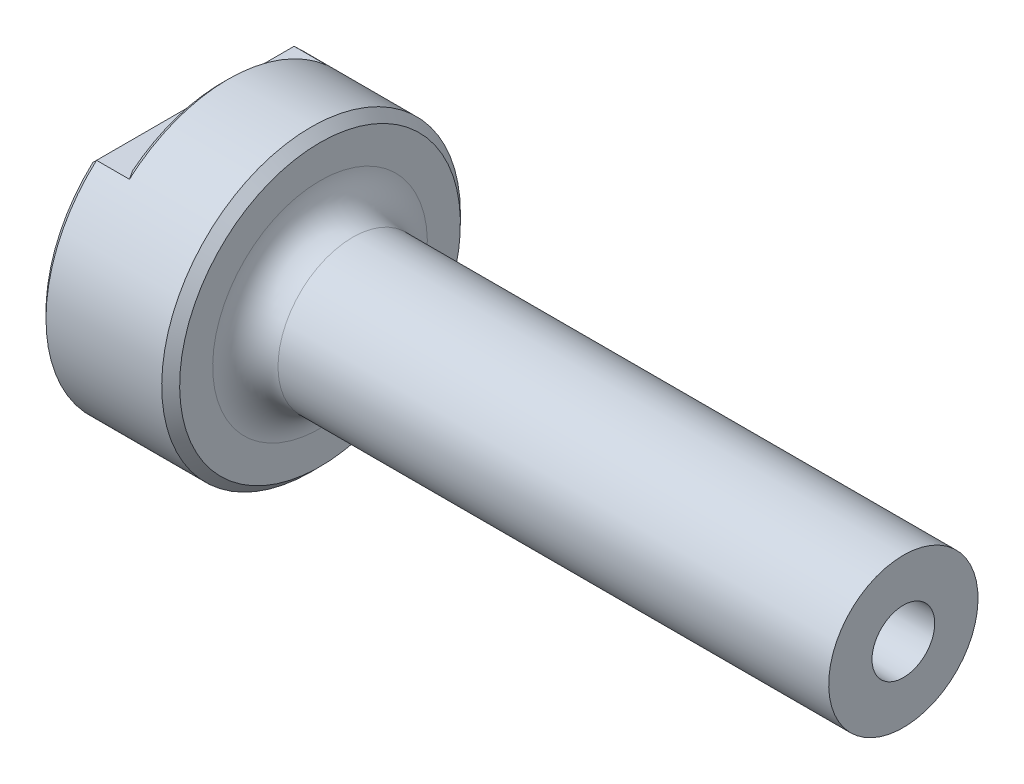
ISO-10303-21;
HEADER;
FILE_DESCRIPTION(('STEP AP214'),'2;1');
FILE_NAME('part.step','',(''),(''),'','','');
FILE_SCHEMA(('AUTOMOTIVE_DESIGN { 1 0 10303 214 1 1 1 1 }'));
ENDSEC;
DATA;
#1=APPLICATION_CONTEXT('core data for automotive mechanical design processes');
#2=APPLICATION_PROTOCOL_DEFINITION('international standard','automotive_design',2000,#1);
#3=PRODUCT_CONTEXT('',#1,'mechanical');
#4=PRODUCT('Part','Part','',(#3));
#5=PRODUCT_RELATED_PRODUCT_CATEGORY('part','',(#4));
#6=PRODUCT_DEFINITION_FORMATION('','',#4);
#7=PRODUCT_DEFINITION_CONTEXT('part definition',#1,'design');
#8=PRODUCT_DEFINITION('design','',#6,#7);
#9=PRODUCT_DEFINITION_SHAPE('','',#8);
#10=(LENGTH_UNIT() NAMED_UNIT(*) SI_UNIT(.MILLI.,.METRE.));
#11=(NAMED_UNIT(*) PLANE_ANGLE_UNIT() SI_UNIT($,.RADIAN.));
#12=(NAMED_UNIT(*) SI_UNIT($,.STERADIAN.) SOLID_ANGLE_UNIT());
#13=UNCERTAINTY_MEASURE_WITH_UNIT(LENGTH_MEASURE(1.E-05),#10,'distance_accuracy_value','');
#14=(GEOMETRIC_REPRESENTATION_CONTEXT(3) GLOBAL_UNCERTAINTY_ASSIGNED_CONTEXT((#13)) GLOBAL_UNIT_ASSIGNED_CONTEXT((#10,
#11,#12)) REPRESENTATION_CONTEXT('',''));
#15=CARTESIAN_POINT('',(0.,0.,0.));
#16=DIRECTION('',(0.,0.,1.));
#17=DIRECTION('',(1.,0.,0.));
#18=AXIS2_PLACEMENT_3D('',#15,#16,#17);
#19=CARTESIAN_POINT('',(60.721875,0.,0.));
#20=DIRECTION('',(1.,0.,0.));
#21=DIRECTION('',(0.,0.,-1.));
#22=AXIS2_PLACEMENT_3D('',#19,#20,#21);
#23=PLANE('',#22);
#24=CARTESIAN_POINT('',(60.721875,0.,0.));
#25=DIRECTION('',(1.,0.,0.));
#26=DIRECTION('',(0.,1.,0.));
#27=AXIS2_PLACEMENT_3D('',#24,#25,#26);
#28=CIRCLE('',#27,12.7);
#29=CARTESIAN_POINT('',(60.721875,12.7,0.));
#30=VERTEX_POINT('',#29);
#31=EDGE_CURVE('E102',#30,#30,#28,.T.);
#32=ORIENTED_EDGE('',*,*,#31,.T.);
#33=EDGE_LOOP('',(#32));
#34=FACE_BOUND('',#33,.T.);
#35=CARTESIAN_POINT('',(60.721875,0.,0.));
#36=DIRECTION('',(1.,0.,0.));
#37=DIRECTION('',(0.,1.,0.));
#38=AXIS2_PLACEMENT_3D('',#35,#36,#37);
#39=CIRCLE('',#38,5.33387866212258);
#40=CARTESIAN_POINT('',(60.721875,5.33387866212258,0.));
#41=VERTEX_POINT('',#40);
#42=EDGE_CURVE('E158',#41,#41,#39,.T.);
#43=ORIENTED_EDGE('',*,*,#42,.F.);
#44=EDGE_LOOP('',(#43));
#45=FACE_BOUND('',#44,.T.);
#46=ADVANCED_FACE('F33',(#34,#45),#23,.T.);
#47=CARTESIAN_POINT('',(-60.721875,0.,0.));
#48=DIRECTION('',(1.,0.,0.));
#49=DIRECTION('',(0.,0.,-1.));
#50=AXIS2_PLACEMENT_3D('',#47,#48,#49);
#51=PLANE('',#50);
#52=CARTESIAN_POINT('',(-60.721875,0.,0.));
#53=DIRECTION('',(1.,0.,0.));
#54=DIRECTION('',(0.,0.,-1.));
#55=AXIS2_PLACEMENT_3D('',#52,#53,#54);
#56=CIRCLE('',#55,24.3839999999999);
#57=CARTESIAN_POINT('',(-60.721875,18.0339999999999,-16.4120169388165));
#58=VERTEX_POINT('',#57);
#59=CARTESIAN_POINT('',(-60.721875,18.0339999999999,16.4120169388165));
#60=VERTEX_POINT('',#59);
#61=EDGE_CURVE('E53',#58,#60,#56,.F.);
#62=ORIENTED_EDGE('',*,*,#61,.T.);
#63=DIRECTION('',(0.,0.,-1.));
#64=VECTOR('',#63,1.);
#65=CARTESIAN_POINT('',(-60.721875,18.0339999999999,0.));
#66=LINE('',#65,#64);
#67=EDGE_CURVE('E127',#60,#58,#66,.T.);
#68=ORIENTED_EDGE('',*,*,#67,.T.);
#69=EDGE_LOOP('',(#62,#68));
#70=FACE_BOUND('',#69,.T.);
#71=CARTESIAN_POINT('',(-60.721875,0.,0.));
#72=DIRECTION('',(1.,0.,0.));
#73=DIRECTION('',(0.,1.,0.));
#74=AXIS2_PLACEMENT_3D('',#71,#72,#73);
#75=CIRCLE('',#74,9.80045101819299);
#76=CARTESIAN_POINT('',(-60.721875,9.80045101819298,0.));
#77=VERTEX_POINT('',#76);
#78=EDGE_CURVE('E107',#77,#77,#75,.T.);
#79=ORIENTED_EDGE('',*,*,#78,.T.);
#80=EDGE_LOOP('',(#79));
#81=FACE_BOUND('',#80,.T.);
#82=ADVANCED_FACE('F167',(#70,#81),#51,.F.);
#83=CARTESIAN_POINT('',(60.721875,0.,0.));
#84=DIRECTION('',(-1.,0.,0.));
#85=DIRECTION('',(0.,0.,1.));
#86=AXIS2_PLACEMENT_3D('',#83,#84,#85);
#87=CYLINDRICAL_SURFACE('',#86,25.4);
#88=CARTESIAN_POINT('',(-40.0208749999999,0.,0.));
#89=DIRECTION('',(1.,0.,0.));
#90=DIRECTION('',(0.,0.,-1.));
#91=AXIS2_PLACEMENT_3D('',#88,#89,#90);
#92=CIRCLE('',#91,25.4);
#93=CARTESIAN_POINT('',(-40.0208749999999,0.,-25.4));
#94=VERTEX_POINT('',#93);
#95=EDGE_CURVE('E98',#94,#94,#92,.F.);
#96=ORIENTED_EDGE('',*,*,#95,.T.);
#97=EDGE_LOOP('',(#96));
#98=FACE_BOUND('',#97,.T.);
#99=DIRECTION('',(-1.,0.,0.));
#100=VECTOR('',#99,1.);
#101=CARTESIAN_POINT('',(60.721875,19.05,-16.8005208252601));
#102=LINE('',#101,#100);
#103=CARTESIAN_POINT('',(-59.7058749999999,19.05,-16.8005208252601));
#104=VERTEX_POINT('',#103);
#105=CARTESIAN_POINT('',(-54.117875,19.05,-16.8005208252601));
#106=VERTEX_POINT('',#105);
#107=EDGE_CURVE('E101',#104,#106,#102,.F.);
#108=ORIENTED_EDGE('',*,*,#107,.T.);
#109=CARTESIAN_POINT('',(-54.117875,0.,0.));
#110=DIRECTION('',(-1.,0.,0.));
#111=DIRECTION('',(0.,0.,1.));
#112=AXIS2_PLACEMENT_3D('',#109,#110,#111);
#113=CIRCLE('',#112,25.4);
#114=CARTESIAN_POINT('',(-54.117875,19.05,16.8005208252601));
#115=VERTEX_POINT('',#114);
#116=EDGE_CURVE('E87',#106,#115,#113,.F.);
#117=ORIENTED_EDGE('',*,*,#116,.T.);
#118=DIRECTION('',(-1.,0.,0.));
#119=VECTOR('',#118,1.);
#120=CARTESIAN_POINT('',(60.721875,19.05,16.8005208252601));
#121=LINE('',#120,#119);
#122=CARTESIAN_POINT('',(-59.7058749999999,19.05,16.8005208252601));
#123=VERTEX_POINT('',#122);
#124=EDGE_CURVE('E104',#115,#123,#121,.T.);
#125=ORIENTED_EDGE('',*,*,#124,.T.);
#126=CARTESIAN_POINT('',(-59.7058749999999,0.,0.));
#127=DIRECTION('',(1.,0.,0.));
#128=DIRECTION('',(0.,0.,-1.));
#129=AXIS2_PLACEMENT_3D('',#126,#127,#128);
#130=CIRCLE('',#129,25.4);
#131=EDGE_CURVE('E97',#123,#104,#130,.T.);
#132=ORIENTED_EDGE('',*,*,#131,.T.);
#133=EDGE_LOOP('',(#108,#117,#125,#132));
#134=FACE_BOUND('',#133,.T.);
#135=ADVANCED_FACE('F189',(#98,#134),#87,.T.);
#136=CARTESIAN_POINT('',(-55.133875,0.,0.));
#137=DIRECTION('',(-1.,0.,0.));
#138=DIRECTION('',(0.,0.,1.));
#139=AXIS2_PLACEMENT_3D('',#136,#137,#138);
#140=PLANE('',#139);
#141=DIRECTION('',(0.,0.,1.));
#142=VECTOR('',#141,1.);
#143=CARTESIAN_POINT('',(-55.133875,19.05,-25.4));
#144=LINE('',#143,#142);
#145=CARTESIAN_POINT('',(-55.133875,19.05,-15.220938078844));
#146=VERTEX_POINT('',#145);
#147=CARTESIAN_POINT('',(-55.133875,19.05,15.220938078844));
#148=VERTEX_POINT('',#147);
#149=EDGE_CURVE('E96',#146,#148,#144,.T.);
#150=ORIENTED_EDGE('',*,*,#149,.T.);
#151=CARTESIAN_POINT('',(-55.133875,0.,0.));
#152=DIRECTION('',(-1.,0.,0.));
#153=DIRECTION('',(0.,0.,1.));
#154=AXIS2_PLACEMENT_3D('',#151,#152,#153);
#155=CIRCLE('',#154,24.384);
#156=EDGE_CURVE('E85',#148,#146,#155,.T.);
#157=ORIENTED_EDGE('',*,*,#156,.T.);
#158=EDGE_LOOP('',(#150,#157));
#159=FACE_BOUND('',#158,.T.);
#160=ADVANCED_FACE('F95',(#159),#140,.T.);
#161=CARTESIAN_POINT('',(-55.133875,19.05,-25.4));
#162=DIRECTION('',(0.,-1.,0.));
#163=DIRECTION('',(0.,0.,-1.));
#164=AXIS2_PLACEMENT_3D('',#161,#162,#163);
#165=PLANE('',#164);
#166=ORIENTED_EDGE('',*,*,#107,.F.);
#167=DIRECTION('',(0.,0.,1.));
#168=VECTOR('',#167,1.);
#169=CARTESIAN_POINT('',(-59.7058749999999,19.05,-25.4));
#170=LINE('',#169,#168);
#171=EDGE_CURVE('E91',#104,#123,#170,.T.);
#172=ORIENTED_EDGE('',*,*,#171,.T.);
#173=ORIENTED_EDGE('',*,*,#124,.F.);
#174=CARTESIAN_POINT('',(-54.117875,19.05,16.8005208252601));
#175=CARTESIAN_POINT('',(-54.2042219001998,19.05,16.6699759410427));
#176=CARTESIAN_POINT('',(-54.290175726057,19.05,16.5391707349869));
#177=CARTESIAN_POINT('',(-54.4612541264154,19.05,16.2770272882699));
#178=CARTESIAN_POINT('',(-54.5463787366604,19.05,16.1456890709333));
#179=CARTESIAN_POINT('',(-54.7157633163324,19.05,15.8824555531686));
#180=CARTESIAN_POINT('',(-54.8000232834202,19.05,15.7505602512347));
#181=CARTESIAN_POINT('',(-54.9676390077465,19.05,15.4861884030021));
#182=CARTESIAN_POINT('',(-55.0509947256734,19.05,15.353711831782));
#183=CARTESIAN_POINT('',(-55.133875,19.05,15.220938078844));
#184=B_SPLINE_CURVE_WITH_KNOTS('',3,(#174,#175,#176,#177,#178,#179,#180,#181,#182,#183),
.UNSPECIFIED.,.F.,.F.,(4,2,2,2,4),(0.,0.469552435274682,0.939084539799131,1.40861791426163,
1.87817162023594),.UNSPECIFIED.);
#185=EDGE_CURVE('E11',#115,#148,#184,.T.);
#186=ORIENTED_EDGE('',*,*,#185,.T.);
#187=ORIENTED_EDGE('',*,*,#149,.F.);
#188=CARTESIAN_POINT('',(-55.133875,19.05,-15.220938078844));
#189=CARTESIAN_POINT('',(-55.0509947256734,19.05,-15.353711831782));
#190=CARTESIAN_POINT('',(-54.9676390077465,19.05,-15.4861884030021));
#191=CARTESIAN_POINT('',(-54.8000232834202,19.05,-15.7505602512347));
#192=CARTESIAN_POINT('',(-54.7157633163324,19.05,-15.8824555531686));
#193=CARTESIAN_POINT('',(-54.5463787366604,19.05,-16.1456890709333));
#194=CARTESIAN_POINT('',(-54.4612541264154,19.05,-16.2770272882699));
#195=CARTESIAN_POINT('',(-54.290175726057,19.05,-16.5391707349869));
#196=CARTESIAN_POINT('',(-54.2042219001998,19.05,-16.6699759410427));
#197=CARTESIAN_POINT('',(-54.117875,19.05,-16.8005208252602));
#198=B_SPLINE_CURVE_WITH_KNOTS('',3,(#188,#189,#190,#191,#192,#193,#194,#195,#196,#197),
.UNSPECIFIED.,.F.,.F.,(4,2,2,2,4),(0.,0.46955370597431,0.939087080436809,1.40861918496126,
1.87817162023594),.UNSPECIFIED.);
#199=EDGE_CURVE('E46',#146,#106,#198,.T.);
#200=ORIENTED_EDGE('',*,*,#199,.T.);
#201=EDGE_LOOP('',(#166,#172,#173,#186,#187,#200));
#202=FACE_BOUND('',#201,.T.);
#203=ADVANCED_FACE('F100',(#202),#165,.F.);
#204=CARTESIAN_POINT('',(-38.496875,-25.4,0.));
#205=DIRECTION('',(1.,0.,0.));
#206=DIRECTION('',(0.,1.,0.));
#207=AXIS2_PLACEMENT_3D('',#204,#205,#206);
#208=PLANE('',#207);
#209=CARTESIAN_POINT('',(-38.496875,0.,0.));
#210=DIRECTION('',(1.,0.,0.));
#211=DIRECTION('',(0.,1.,0.));
#212=AXIS2_PLACEMENT_3D('',#209,#210,#211);
#213=CIRCLE('',#212,23.8760000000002);
#214=CARTESIAN_POINT('',(-38.496875,23.8760000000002,0.));
#215=VERTEX_POINT('',#214);
#216=EDGE_CURVE('E119',#215,#215,#213,.T.);
#217=ORIENTED_EDGE('',*,*,#216,.T.);
#218=EDGE_LOOP('',(#217));
#219=FACE_BOUND('',#218,.T.);
#220=CARTESIAN_POINT('',(-38.496875,0.,0.));
#221=DIRECTION('',(1.,0.,0.));
#222=DIRECTION('',(0.,1.,0.));
#223=AXIS2_PLACEMENT_3D('',#220,#221,#222);
#224=CIRCLE('',#223,18.25625);
#225=CARTESIAN_POINT('',(-38.496875,18.25625,0.));
#226=VERTEX_POINT('',#225);
#227=EDGE_CURVE('E116',#226,#226,#224,.F.);
#228=ORIENTED_EDGE('',*,*,#227,.T.);
#229=EDGE_LOOP('',(#228));
#230=FACE_BOUND('',#229,.T.);
#231=ADVANCED_FACE('F181',(#219,#230),#208,.T.);
#232=CARTESIAN_POINT('',(60.721875,0.,0.));
#233=DIRECTION('',(1.,0.,0.));
#234=DIRECTION('',(0.,1.,0.));
#235=AXIS2_PLACEMENT_3D('',#232,#233,#234);
#236=CYLINDRICAL_SURFACE('',#235,12.7);
#237=CARTESIAN_POINT('',(-32.940625,0.,0.));
#238=DIRECTION('',(1.,0.,0.));
#239=DIRECTION('',(0.,1.,0.));
#240=AXIS2_PLACEMENT_3D('',#237,#238,#239);
#241=CIRCLE('',#240,12.7);
#242=CARTESIAN_POINT('',(-32.940625,12.7,0.));
#243=VERTEX_POINT('',#242);
#244=EDGE_CURVE('E113',#243,#243,#241,.T.);
#245=ORIENTED_EDGE('',*,*,#244,.T.);
#246=EDGE_LOOP('',(#245));
#247=FACE_BOUND('',#246,.T.);
#248=ORIENTED_EDGE('',*,*,#31,.F.);
#249=EDGE_LOOP('',(#248));
#250=FACE_BOUND('',#249,.T.);
#251=ADVANCED_FACE('F172',(#247,#250),#236,.T.);
#252=CARTESIAN_POINT('',(-68.799075,0.,0.));
#253=DIRECTION('',(1.,0.,0.));
#254=DIRECTION('',(0.,1.,0.));
#255=AXIS2_PLACEMENT_3D('',#252,#253,#254);
#256=SPHERICAL_SURFACE('',#255,12.7);
#257=CARTESIAN_POINT('',(-56.4066570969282,0.,0.));
#258=DIRECTION('',(1.,0.,0.));
#259=DIRECTION('',(0.,1.,0.));
#260=AXIS2_PLACEMENT_3D('',#257,#258,#259);
#261=CIRCLE('',#260,2.778125);
#262=CARTESIAN_POINT('',(-56.4066570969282,2.77812499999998,0.));
#263=VERTEX_POINT('',#262);
#264=EDGE_CURVE('E155',#263,#263,#261,.T.);
#265=CARTESIAN_POINT('',(-56.4066570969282,2.77812499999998,0.));
#266=CARTESIAN_POINT('',(-56.425784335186,2.8634467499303,0.));
#267=CARTESIAN_POINT('',(-56.4457929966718,2.9485708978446,0.));
#268=CARTESIAN_POINT('',(-56.4875640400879,3.11838781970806,0.));
#269=CARTESIAN_POINT('',(-56.5093264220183,3.20308059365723,0.));
#270=CARTESIAN_POINT('',(-56.5545957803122,3.37199859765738,0.));
#271=CARTESIAN_POINT('',(-56.5781027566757,3.45622382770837,0.));
#272=CARTESIAN_POINT('',(-56.626851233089,3.62417082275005,0.));
#273=CARTESIAN_POINT('',(-56.6520927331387,3.70789258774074,0.));
#274=CARTESIAN_POINT('',(-56.7042994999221,3.87479693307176,0.));
#275=CARTESIAN_POINT('',(-56.7312647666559,3.95797951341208,0.));
#276=CARTESIAN_POINT('',(-56.7869075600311,4.12377000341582,0.));
#277=CARTESIAN_POINT('',(-56.8155850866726,4.20637791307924,0.));
#278=CARTESIAN_POINT('',(-56.874640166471,4.37098381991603,0.));
#279=CARTESIAN_POINT('',(-56.9050177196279,4.4529818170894,0.));
#280=CARTESIAN_POINT('',(-56.9674598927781,4.61633291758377,0.));
#281=CARTESIAN_POINT('',(-56.9995245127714,4.69768602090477,0.));
#282=CARTESIAN_POINT('',(-57.0653271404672,4.85971262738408,0.));
#283=CARTESIAN_POINT('',(-57.0990651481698,4.94038613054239,0.));
#284=CARTESIAN_POINT('',(-57.1682001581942,5.10101912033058,0.));
#285=CARTESIAN_POINT('',(-57.2035971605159,5.18097860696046,0.));
#286=CARTESIAN_POINT('',(-57.2760350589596,5.34014945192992,0.));
#287=CARTESIAN_POINT('',(-57.3130759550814,5.41936081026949,0.));
#288=CARTESIAN_POINT('',(-57.3887858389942,5.57700160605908,0.));
#289=CARTESIAN_POINT('',(-57.4274548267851,5.65543104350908,0.));
#290=CARTESIAN_POINT('',(-57.5064043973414,5.81147453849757,0.));
#291=CARTESIAN_POINT('',(-57.5466849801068,5.88908859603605,0.));
#292=CARTESIAN_POINT('',(-57.6288405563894,6.04346822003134,0.));
#293=CARTESIAN_POINT('',(-57.6707155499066,6.12023378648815,0.));
#294=CARTESIAN_POINT('',(-57.756042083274,6.2728836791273,0.));
#295=CARTESIAN_POINT('',(-57.7994936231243,6.34876800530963,0.));
#296=CARTESIAN_POINT('',(-57.8879547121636,6.49962304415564,0.));
#297=CARTESIAN_POINT('',(-57.9329642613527,6.57459375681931,0.));
#298=CARTESIAN_POINT('',(-58.0245221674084,6.72358958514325,0.));
#299=CARTESIAN_POINT('',(-58.0710705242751,6.79761470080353,0.));
#300=CARTESIAN_POINT('',(-58.1656861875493,6.94468775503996,0.));
#301=CARTESIAN_POINT('',(-58.2137534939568,7.01773569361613,0.));
#302=CARTESIAN_POINT('',(-58.3113865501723,7.16282323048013,0.));
#303=CARTESIAN_POINT('',(-58.3609522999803,7.23486282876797,0.));
#304=CARTESIAN_POINT('',(-58.4615610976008,7.37790295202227,0.));
#305=CARTESIAN_POINT('',(-58.5126041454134,7.44890347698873,0.));
#306=CARTESIAN_POINT('',(-58.6161457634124,7.58983516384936,0.));
#307=CARTESIAN_POINT('',(-58.668644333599,7.65976632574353,0.));
#308=CARTESIAN_POINT('',(-58.7750745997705,7.79852945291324,0.));
#309=CARTESIAN_POINT('',(-58.8290062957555,7.86736141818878,0.));
#310=CARTESIAN_POINT('',(-58.9382798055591,8.00389678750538,0.));
#311=CARTESIAN_POINT('',(-58.9936216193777,8.07160019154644,0.));
#312=CARTESIAN_POINT('',(-59.1056917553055,8.20584955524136,0.));
#313=CARTESIAN_POINT('',(-59.1624200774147,8.27239551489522,0.));
#314=CARTESIAN_POINT('',(-59.2772390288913,8.40430160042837,0.));
#315=CARTESIAN_POINT('',(-59.3353296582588,8.46966172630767,0.));
#316=CARTESIAN_POINT('',(-59.452848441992,8.59916826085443,0.));
#317=CARTESIAN_POINT('',(-59.5122765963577,8.6633146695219,0.));
#318=CARTESIAN_POINT('',(-59.6324450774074,8.79036640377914,0.));
#319=CARTESIAN_POINT('',(-59.6931854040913,8.8532717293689,0.));
#320=CARTESIAN_POINT('',(-59.8159523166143,8.9778144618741,0.));
#321=CARTESIAN_POINT('',(-59.8779789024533,9.03945186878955,0.));
#322=CARTESIAN_POINT('',(-60.0032918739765,9.16143246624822,0.));
#323=CARTESIAN_POINT('',(-60.0665782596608,9.22177565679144,0.));
#324=CARTESIAN_POINT('',(-60.1943838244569,9.3411420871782,0.));
#325=CARTESIAN_POINT('',(-60.2589030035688,9.40016532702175,0.));
#326=CARTESIAN_POINT('',(-60.3891466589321,9.51686664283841,0.));
#327=CARTESIAN_POINT('',(-60.4548711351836,9.57454471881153,0.));
#328=CARTESIAN_POINT('',(-60.5874972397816,9.6885312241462,0.));
#329=CARTESIAN_POINT('',(-60.6543988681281,9.74483965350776,0.));
#330=CARTESIAN_POINT('',(-60.721875,9.80045101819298,0.));
#331=B_SPLINE_CURVE_WITH_KNOTS('',3,(#265,#266,#267,#268,#269,#270,#271,#272,#273,#274,#275,
#276,#277,#278,#279,#280,#281,#282,#283,#284,#285,#286,#287,#288,#289,#290,#291,#292,#293,#294,
#295,#296,#297,#298,#299,#300,#301,#302,#303,#304,#305,#306,#307,#308,#309,#310,#311,#312,#313,
#314,#315,#316,#317,#318,#319,#320,#321,#322,#323,#324,#325,#326,#327,#328,#329,#330),
.UNSPECIFIED.,.F.,.F.,(4,2,2,2,2,2,2,2,2,2,2,2,2,2,2,2,2,2,2,2,2,2,2,2,2,2,2,2,2,2,2,2,4),(0.,
0.262313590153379,0.524627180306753,0.786940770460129,1.04925436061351,1.31156795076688,
1.57388154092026,1.83619513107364,2.09850872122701,2.36082231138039,2.62313590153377,
2.88544949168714,3.14776308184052,3.4100766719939,3.67239026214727,3.93470385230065,
4.19701744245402,4.4593310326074,4.72164462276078,4.98395821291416,5.24627180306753,
5.50858539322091,5.77089898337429,6.03321257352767,6.29552616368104,6.55783975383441,
6.8201533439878,7.08246693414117,7.34478052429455,7.60709411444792,7.8694077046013,
8.13172129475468,8.39403488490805),.UNSPECIFIED.);
#332=EDGE_CURVE('BSEAM169',#263,#77,#331,.T.);
#333=ORIENTED_EDGE('',*,*,#264,.T.);
#334=ORIENTED_EDGE('',*,*,#78,.F.);
#335=ORIENTED_EDGE('',*,*,#332,.T.);
#336=ORIENTED_EDGE('',*,*,#332,.F.);
#337=EDGE_LOOP('',(#333,#335,#334,#336));
#338=FACE_BOUND('',#337,.T.);
#339=ADVANCED_FACE('F169',(#338),#256,.F.);
#340=CARTESIAN_POINT('',(-56.4066570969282,0.,0.));
#341=DIRECTION('',(1.,0.,0.));
#342=DIRECTION('',(0.,1.,0.));
#343=AXIS2_PLACEMENT_3D('',#340,#341,#342);
#344=CONICAL_SURFACE('',#343,2.778125,0.0218166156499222);
#345=ORIENTED_EDGE('',*,*,#42,.T.);
#346=EDGE_LOOP('',(#345));
#347=FACE_BOUND('',#346,.T.);
#348=ORIENTED_EDGE('',*,*,#264,.F.);
#349=EDGE_LOOP('',(#348));
#350=FACE_BOUND('',#349,.T.);
#351=ADVANCED_FACE('F171',(#347,#350),#344,.F.);
#352=CARTESIAN_POINT('',(-32.940625,0.,0.));
#353=DIRECTION('',(1.,0.,0.));
#354=DIRECTION('',(0.,1.,0.));
#355=AXIS2_PLACEMENT_3D('',#352,#353,#354);
#356=TOROIDAL_SURFACE('',#355,18.25625,5.55625);
#357=ORIENTED_EDGE('',*,*,#227,.F.);
#358=EDGE_LOOP('',(#357));
#359=FACE_BOUND('',#358,.T.);
#360=ORIENTED_EDGE('',*,*,#244,.F.);
#361=EDGE_LOOP('',(#360));
#362=FACE_BOUND('',#361,.T.);
#363=ADVANCED_FACE('F178',(#359,#362),#356,.F.);
#364=CARTESIAN_POINT('',(-38.496875,0.,0.));
#365=DIRECTION('',(-1.,0.,0.));
#366=DIRECTION('',(0.,0.,1.));
#367=AXIS2_PLACEMENT_3D('',#364,#365,#366);
#368=CONICAL_SURFACE('',#367,23.8760000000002,0.785398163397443);
#369=ORIENTED_EDGE('',*,*,#95,.F.);
#370=EDGE_LOOP('',(#369));
#371=FACE_BOUND('',#370,.T.);
#372=ORIENTED_EDGE('',*,*,#216,.F.);
#373=EDGE_LOOP('',(#372));
#374=FACE_BOUND('',#373,.T.);
#375=ADVANCED_FACE('F145',(#371,#374),#368,.T.);
#376=CARTESIAN_POINT('',(-55.133875,0.,0.));
#377=DIRECTION('',(1.,0.,0.));
#378=DIRECTION('',(0.,0.,-1.));
#379=AXIS2_PLACEMENT_3D('',#376,#377,#378);
#380=CONICAL_SURFACE('',#379,24.384,0.785398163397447);
#381=ORIENTED_EDGE('',*,*,#185,.F.);
#382=ORIENTED_EDGE('',*,*,#116,.F.);
#383=ORIENTED_EDGE('',*,*,#199,.F.);
#384=ORIENTED_EDGE('',*,*,#156,.F.);
#385=EDGE_LOOP('',(#381,#382,#383,#384));
#386=FACE_BOUND('',#385,.T.);
#387=ADVANCED_FACE('F84',(#386),#380,.T.);
#388=CARTESIAN_POINT('',(-59.7058749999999,0.,0.));
#389=DIRECTION('',(1.,0.,0.));
#390=DIRECTION('',(0.,0.,-1.));
#391=AXIS2_PLACEMENT_3D('',#388,#389,#390);
#392=CONICAL_SURFACE('',#391,25.4,0.785398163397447);
#393=CARTESIAN_POINT('',(-60.721875,18.0339999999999,-16.4120169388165));
#394=CARTESIAN_POINT('',(-60.552676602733,18.203198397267,-16.4774733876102));
#395=CARTESIAN_POINT('',(-60.3834107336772,18.3724642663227,-16.5425769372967));
#396=CARTESIAN_POINT('',(-60.0447440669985,18.7111309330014,-16.6720782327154));
#397=CARTESIAN_POINT('',(-59.8753432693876,18.8805317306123,-16.7364759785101));
#398=CARTESIAN_POINT('',(-59.7058749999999,19.05,-16.8005208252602));
#399=B_SPLINE_CURVE_WITH_KNOTS('',3,(#393,#394,#395,#396,#397,#398),.UNSPECIFIED.,.F.,.F.,(4,2,
4),(0.,0.744219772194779,1.48843947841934),.UNSPECIFIED.);
#400=EDGE_CURVE('E61',#104,#58,#399,.F.);
#401=ORIENTED_EDGE('',*,*,#400,.F.);
#402=ORIENTED_EDGE('',*,*,#131,.F.);
#403=CARTESIAN_POINT('',(-59.7058749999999,19.05,16.8005208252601));
#404=CARTESIAN_POINT('',(-59.8753432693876,18.8805317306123,16.7364759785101));
#405=CARTESIAN_POINT('',(-60.0447440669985,18.7111309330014,16.6720782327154));
#406=CARTESIAN_POINT('',(-60.3834107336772,18.3724642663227,16.5425769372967));
#407=CARTESIAN_POINT('',(-60.552676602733,18.203198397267,16.4774733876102));
#408=CARTESIAN_POINT('',(-60.721875,18.0339999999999,16.4120169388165));
#409=B_SPLINE_CURVE_WITH_KNOTS('',3,(#403,#404,#405,#406,#407,#408),.UNSPECIFIED.,.F.,.F.,(4,2,
4),(0.,0.744219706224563,1.48843947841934),.UNSPECIFIED.);
#410=EDGE_CURVE('E38',#60,#123,#409,.F.);
#411=ORIENTED_EDGE('',*,*,#410,.F.);
#412=ORIENTED_EDGE('',*,*,#61,.F.);
#413=EDGE_LOOP('',(#401,#402,#411,#412));
#414=FACE_BOUND('',#413,.T.);
#415=ADVANCED_FACE('F144',(#414),#392,.T.);
#416=CARTESIAN_POINT('',(-60.721875,18.0339999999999,0.));
#417=DIRECTION('',(0.707106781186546,-0.707106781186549,0.));
#418=DIRECTION('',(0.,0.,-1.));
#419=AXIS2_PLACEMENT_3D('',#416,#417,#418);
#420=PLANE('',#419);
#421=ORIENTED_EDGE('',*,*,#410,.T.);
#422=ORIENTED_EDGE('',*,*,#171,.F.);
#423=ORIENTED_EDGE('',*,*,#400,.T.);
#424=ORIENTED_EDGE('',*,*,#67,.F.);
#425=EDGE_LOOP('',(#421,#422,#423,#424));
#426=FACE_BOUND('',#425,.T.);
#427=ADVANCED_FACE('F35',(#426),#420,.F.);
#428=CLOSED_SHELL('',(#46,#82,#135,#160,#203,#231,#251,#339,#351,#363,#375,#387,#415,#427));
#429=MANIFOLD_SOLID_BREP('B2',#428);
#430=ADVANCED_BREP_SHAPE_REPRESENTATION('',(#18,#429),#14);
#431=SHAPE_DEFINITION_REPRESENTATION(#9,#430);
ENDSEC;
END-ISO-10303-21;
